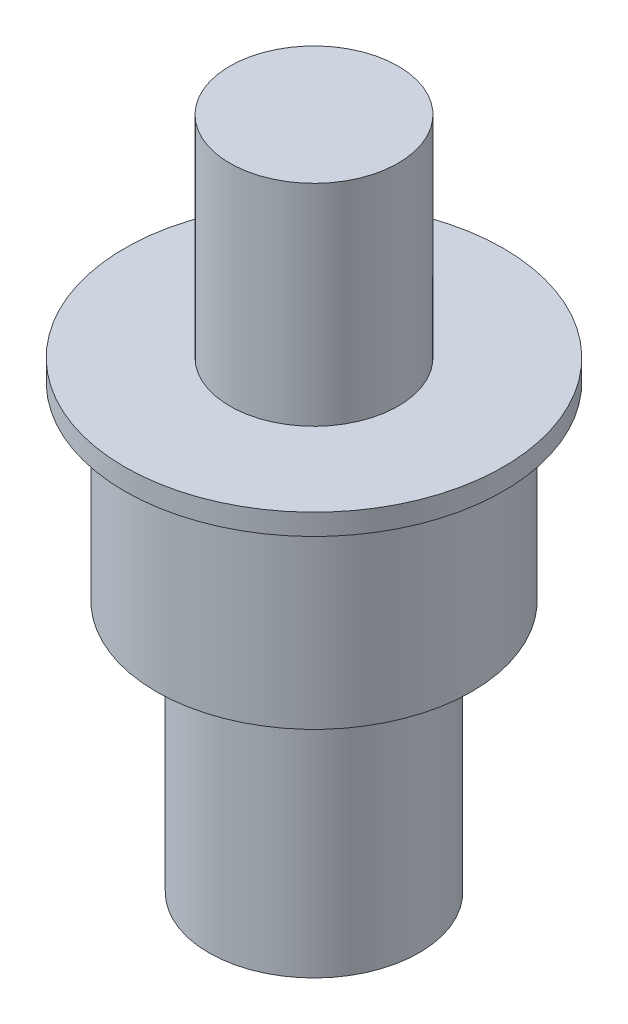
ISO-10303-21;
HEADER;
FILE_DESCRIPTION(('STEP AP214'),'2;1');
FILE_NAME('part.step','',(''),(''),'','','');
FILE_SCHEMA(('AUTOMOTIVE_DESIGN { 1 0 10303 214 1 1 1 1 }'));
ENDSEC;
DATA;
#1=APPLICATION_CONTEXT('core data for automotive mechanical design processes');
#2=APPLICATION_PROTOCOL_DEFINITION('international standard','automotive_design',2000,#1);
#3=PRODUCT_CONTEXT('',#1,'mechanical');
#4=PRODUCT('Part','Part','',(#3));
#5=PRODUCT_RELATED_PRODUCT_CATEGORY('part','',(#4));
#6=PRODUCT_DEFINITION_FORMATION('','',#4);
#7=PRODUCT_DEFINITION_CONTEXT('part definition',#1,'design');
#8=PRODUCT_DEFINITION('design','',#6,#7);
#9=PRODUCT_DEFINITION_SHAPE('','',#8);
#10=(LENGTH_UNIT() NAMED_UNIT(*) SI_UNIT(.MILLI.,.METRE.));
#11=(NAMED_UNIT(*) PLANE_ANGLE_UNIT() SI_UNIT($,.RADIAN.));
#12=(NAMED_UNIT(*) SI_UNIT($,.STERADIAN.) SOLID_ANGLE_UNIT());
#13=UNCERTAINTY_MEASURE_WITH_UNIT(LENGTH_MEASURE(1.E-05),#10,'distance_accuracy_value','');
#14=(GEOMETRIC_REPRESENTATION_CONTEXT(3) GLOBAL_UNCERTAINTY_ASSIGNED_CONTEXT((#13)) GLOBAL_UNIT_ASSIGNED_CONTEXT((#10,
#11,#12)) REPRESENTATION_CONTEXT('',''));
#15=CARTESIAN_POINT('',(0.,0.,0.));
#16=DIRECTION('',(0.,0.,1.));
#17=DIRECTION('',(1.,0.,0.));
#18=AXIS2_PLACEMENT_3D('',#15,#16,#17);
#19=CARTESIAN_POINT('',(0.,-1.5,0.));
#20=DIRECTION('',(0.,1.,0.));
#21=DIRECTION('',(0.,0.,1.));
#22=AXIS2_PLACEMENT_3D('',#19,#20,#21);
#23=PLANE('',#22);
#24=CARTESIAN_POINT('',(0.,-1.50000000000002,0.));
#25=DIRECTION('',(0.,-1.,0.));
#26=DIRECTION('',(0.,0.,-1.));
#27=AXIS2_PLACEMENT_3D('',#24,#25,#26);
#28=CIRCLE('',#27,4.);
#29=CARTESIAN_POINT('',(0.,-1.50000000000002,-4.));
#30=VERTEX_POINT('',#29);
#31=EDGE_CURVE('E18',#30,#30,#28,.T.);
#32=ORIENTED_EDGE('',*,*,#31,.F.);
#33=EDGE_LOOP('',(#32));
#34=FACE_BOUND('',#33,.T.);
#35=ADVANCED_FACE('F15',(#34),#23,.T.);
#36=CARTESIAN_POINT('',(0.,-33.5,0.));
#37=DIRECTION('',(0.,-1.,0.));
#38=DIRECTION('',(0.,0.,-1.));
#39=AXIS2_PLACEMENT_3D('',#36,#37,#38);
#40=CYLINDRICAL_SURFACE('',#39,4.);
#41=ORIENTED_EDGE('',*,*,#31,.T.);
#42=EDGE_LOOP('',(#41));
#43=FACE_BOUND('',#42,.T.);
#44=CARTESIAN_POINT('',(0.,-11.5,0.));
#45=DIRECTION('',(0.,-1.,0.));
#46=DIRECTION('',(0.,0.,-1.));
#47=AXIS2_PLACEMENT_3D('',#44,#45,#46);
#48=CIRCLE('',#47,4.);
#49=CARTESIAN_POINT('',(0.,-11.5,-4.));
#50=VERTEX_POINT('',#49);
#51=EDGE_CURVE('E40',#50,#50,#48,.T.);
#52=ORIENTED_EDGE('',*,*,#51,.F.);
#53=EDGE_LOOP('',(#52));
#54=FACE_BOUND('',#53,.T.);
#55=ADVANCED_FACE('F47',(#43,#54),#40,.T.);
#56=CARTESIAN_POINT('',(0.,-33.5,0.));
#57=DIRECTION('',(0.,-1.,0.));
#58=DIRECTION('',(0.,0.,-1.));
#59=AXIS2_PLACEMENT_3D('',#56,#57,#58);
#60=PLANE('',#59);
#61=CARTESIAN_POINT('',(0.,-33.5,0.));
#62=DIRECTION('',(0.,1.,0.));
#63=DIRECTION('',(0.,0.,1.));
#64=AXIS2_PLACEMENT_3D('',#61,#62,#63);
#65=CIRCLE('',#64,5.);
#66=CARTESIAN_POINT('',(0.,-33.5,5.));
#67=VERTEX_POINT('',#66);
#68=EDGE_CURVE('E38',#67,#67,#65,.T.);
#69=ORIENTED_EDGE('',*,*,#68,.F.);
#70=EDGE_LOOP('',(#69));
#71=FACE_BOUND('',#70,.T.);
#72=ADVANCED_FACE('F55',(#71),#60,.T.);
#73=CARTESIAN_POINT('',(0.,-11.5,0.));
#74=DIRECTION('',(0.,1.,0.));
#75=DIRECTION('',(0.,0.,1.));
#76=AXIS2_PLACEMENT_3D('',#73,#74,#75);
#77=PLANE('',#76);
#78=CARTESIAN_POINT('',(0.,-11.5,0.));
#79=DIRECTION('',(0.,-1.,0.));
#80=DIRECTION('',(0.,0.,-1.));
#81=AXIS2_PLACEMENT_3D('',#78,#79,#80);
#82=CIRCLE('',#81,9.);
#83=CARTESIAN_POINT('',(0.,-11.5,-9.));
#84=VERTEX_POINT('',#83);
#85=EDGE_CURVE('E35',#84,#84,#82,.T.);
#86=ORIENTED_EDGE('',*,*,#85,.F.);
#87=EDGE_LOOP('',(#86));
#88=FACE_BOUND('',#87,.T.);
#89=ORIENTED_EDGE('',*,*,#51,.T.);
#90=EDGE_LOOP('',(#89));
#91=FACE_BOUND('',#90,.T.);
#92=ADVANCED_FACE('F78',(#88,#91),#77,.T.);
#93=CARTESIAN_POINT('',(0.,-33.5,0.));
#94=DIRECTION('',(0.,1.,0.));
#95=DIRECTION('',(0.,0.,1.));
#96=AXIS2_PLACEMENT_3D('',#93,#94,#95);
#97=CYLINDRICAL_SURFACE('',#96,5.);
#98=CARTESIAN_POINT('',(0.,-21.5,0.));
#99=DIRECTION('',(0.,1.,0.));
#100=DIRECTION('',(0.,0.,1.));
#101=AXIS2_PLACEMENT_3D('',#98,#99,#100);
#102=CIRCLE('',#101,5.);
#103=CARTESIAN_POINT('',(0.,-21.5,5.));
#104=VERTEX_POINT('',#103);
#105=EDGE_CURVE('E32',#104,#104,#102,.T.);
#106=ORIENTED_EDGE('',*,*,#105,.F.);
#107=EDGE_LOOP('',(#106));
#108=FACE_BOUND('',#107,.T.);
#109=ORIENTED_EDGE('',*,*,#68,.T.);
#110=EDGE_LOOP('',(#109));
#111=FACE_BOUND('',#110,.T.);
#112=ADVANCED_FACE('F74',(#108,#111),#97,.T.);
#113=CARTESIAN_POINT('',(0.,-11.5,0.));
#114=DIRECTION('',(0.,-1.,0.));
#115=DIRECTION('',(0.,0.,-1.));
#116=AXIS2_PLACEMENT_3D('',#113,#114,#115);
#117=CYLINDRICAL_SURFACE('',#116,9.);
#118=ORIENTED_EDGE('',*,*,#85,.T.);
#119=EDGE_LOOP('',(#118));
#120=FACE_BOUND('',#119,.T.);
#121=CARTESIAN_POINT('',(0.,-12.5,0.));
#122=DIRECTION('',(0.,-1.,0.));
#123=DIRECTION('',(0.,0.,-1.));
#124=AXIS2_PLACEMENT_3D('',#121,#122,#123);
#125=CIRCLE('',#124,9.);
#126=CARTESIAN_POINT('',(0.,-12.5,-9.));
#127=VERTEX_POINT('',#126);
#128=EDGE_CURVE('E27',#127,#127,#125,.F.);
#129=ORIENTED_EDGE('',*,*,#128,.T.);
#130=EDGE_LOOP('',(#129));
#131=FACE_BOUND('',#130,.T.);
#132=ADVANCED_FACE('F70',(#120,#131),#117,.T.);
#133=CARTESIAN_POINT('',(0.,-21.5,0.));
#134=DIRECTION('',(0.,-1.,0.));
#135=DIRECTION('',(0.,0.,-1.));
#136=AXIS2_PLACEMENT_3D('',#133,#134,#135);
#137=PLANE('',#136);
#138=ORIENTED_EDGE('',*,*,#105,.T.);
#139=EDGE_LOOP('',(#138));
#140=FACE_BOUND('',#139,.T.);
#141=CARTESIAN_POINT('',(0.,-21.5,0.));
#142=DIRECTION('',(0.,1.,0.));
#143=DIRECTION('',(0.,0.,1.));
#144=AXIS2_PLACEMENT_3D('',#141,#142,#143);
#145=CIRCLE('',#144,7.5);
#146=CARTESIAN_POINT('',(0.,-21.5,7.5));
#147=VERTEX_POINT('',#146);
#148=EDGE_CURVE('E22',#147,#147,#145,.T.);
#149=ORIENTED_EDGE('',*,*,#148,.F.);
#150=EDGE_LOOP('',(#149));
#151=FACE_BOUND('',#150,.T.);
#152=ADVANCED_FACE('F63',(#140,#151),#137,.T.);
#153=CARTESIAN_POINT('',(0.,-12.5,0.));
#154=DIRECTION('',(0.,1.,0.));
#155=DIRECTION('',(0.,0.,1.));
#156=AXIS2_PLACEMENT_3D('',#153,#154,#155);
#157=PLANE('',#156);
#158=CARTESIAN_POINT('',(0.,-12.5,0.));
#159=DIRECTION('',(0.,1.,0.));
#160=DIRECTION('',(0.,0.,1.));
#161=AXIS2_PLACEMENT_3D('',#158,#159,#160);
#162=CIRCLE('',#161,7.5);
#163=CARTESIAN_POINT('',(0.,-12.5,7.5));
#164=VERTEX_POINT('',#163);
#165=EDGE_CURVE('E10',#164,#164,#162,.F.);
#166=ORIENTED_EDGE('',*,*,#165,.F.);
#167=EDGE_LOOP('',(#166));
#168=FACE_BOUND('',#167,.T.);
#169=ORIENTED_EDGE('',*,*,#128,.F.);
#170=EDGE_LOOP('',(#169));
#171=FACE_BOUND('',#170,.T.);
#172=ADVANCED_FACE('F58',(#168,#171),#157,.F.);
#173=CARTESIAN_POINT('',(0.,-21.5,0.));
#174=DIRECTION('',(0.,1.,0.));
#175=DIRECTION('',(0.,0.,1.));
#176=AXIS2_PLACEMENT_3D('',#173,#174,#175);
#177=CYLINDRICAL_SURFACE('',#176,7.5);
#178=ORIENTED_EDGE('',*,*,#165,.T.);
#179=EDGE_LOOP('',(#178));
#180=FACE_BOUND('',#179,.T.);
#181=ORIENTED_EDGE('',*,*,#148,.T.);
#182=EDGE_LOOP('',(#181));
#183=FACE_BOUND('',#182,.T.);
#184=ADVANCED_FACE('F56',(#180,#183),#177,.T.);
#185=CLOSED_SHELL('',(#35,#55,#72,#92,#112,#132,#152,#172,#184));
#186=MANIFOLD_SOLID_BREP('B1',#185);
#187=ADVANCED_BREP_SHAPE_REPRESENTATION('',(#18,#186),#14);
#188=SHAPE_DEFINITION_REPRESENTATION(#9,#187);
ENDSEC;
END-ISO-10303-21;
